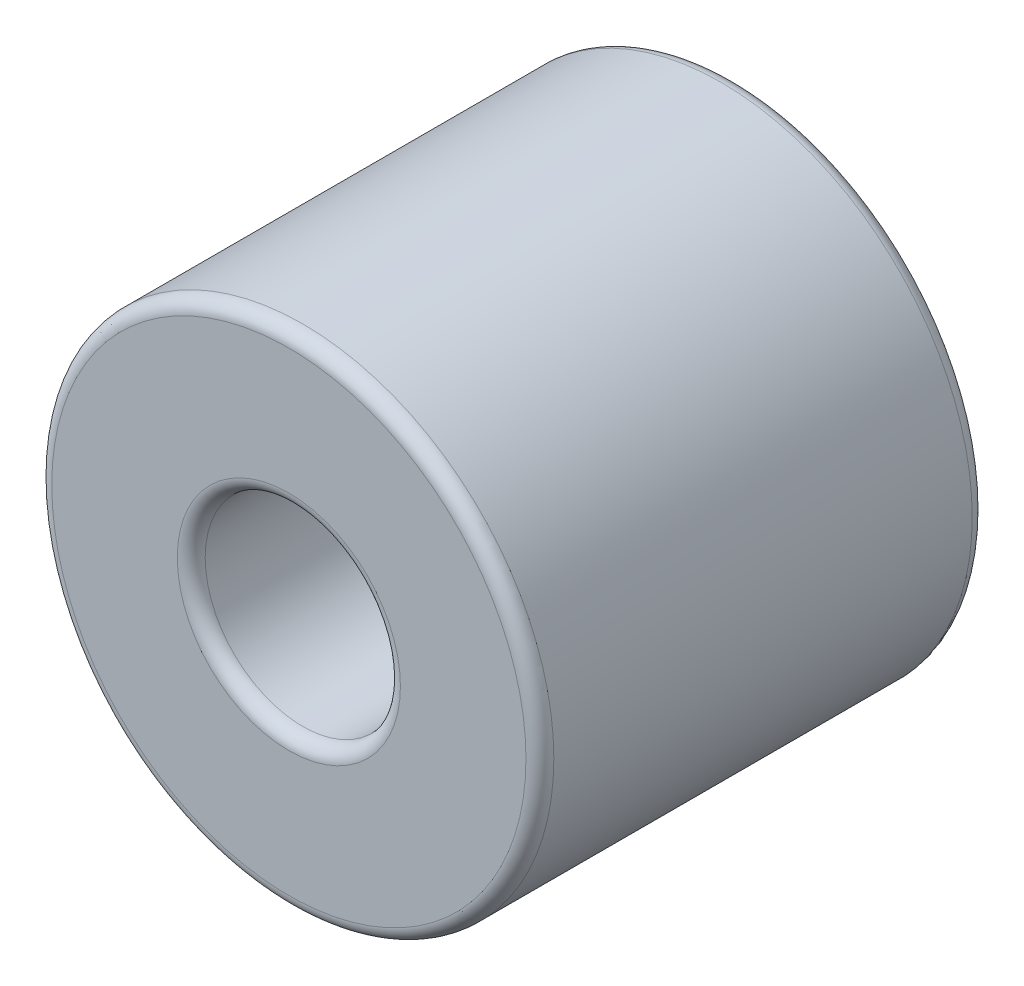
from build123d import *

# Parameters (mm, degrees)
SKETCH_1_W = 8
SKETCH_1_H = 2.75
FILLET_1_R = 0.25


with BuildPart() as part:
    # Sketch 1 → Revolve 1 (revolve)
    with BuildSketch(Plane(origin=(0, 0, 0), x_dir=(0, 0, -1), z_dir=(1, 0, 0)), mode=Mode.PRIVATE) as revolve_1_sk:
        with Locations((0, 3.125)):
            Rectangle(SKETCH_1_W, SKETCH_1_H)
    revolve(revolve_1_sk.sketch.rotate(Axis((0, 0, 4), (0, 0, -1)), 90), axis=Axis((0, 0, 4), (0, 0, -1)))

    # Fillet 1
    fillet_1_edges = [part.edges().sort_by_distance(p)[0] for p in [
        (-4.5, 0, 4),
        (-4.5, 0, -4),
        (-1.75, 0, -4),
        (-1.75, 0, 4),
    ]]
    fillet(fillet_1_edges, radius=FILLET_1_R)


solid = part.part
